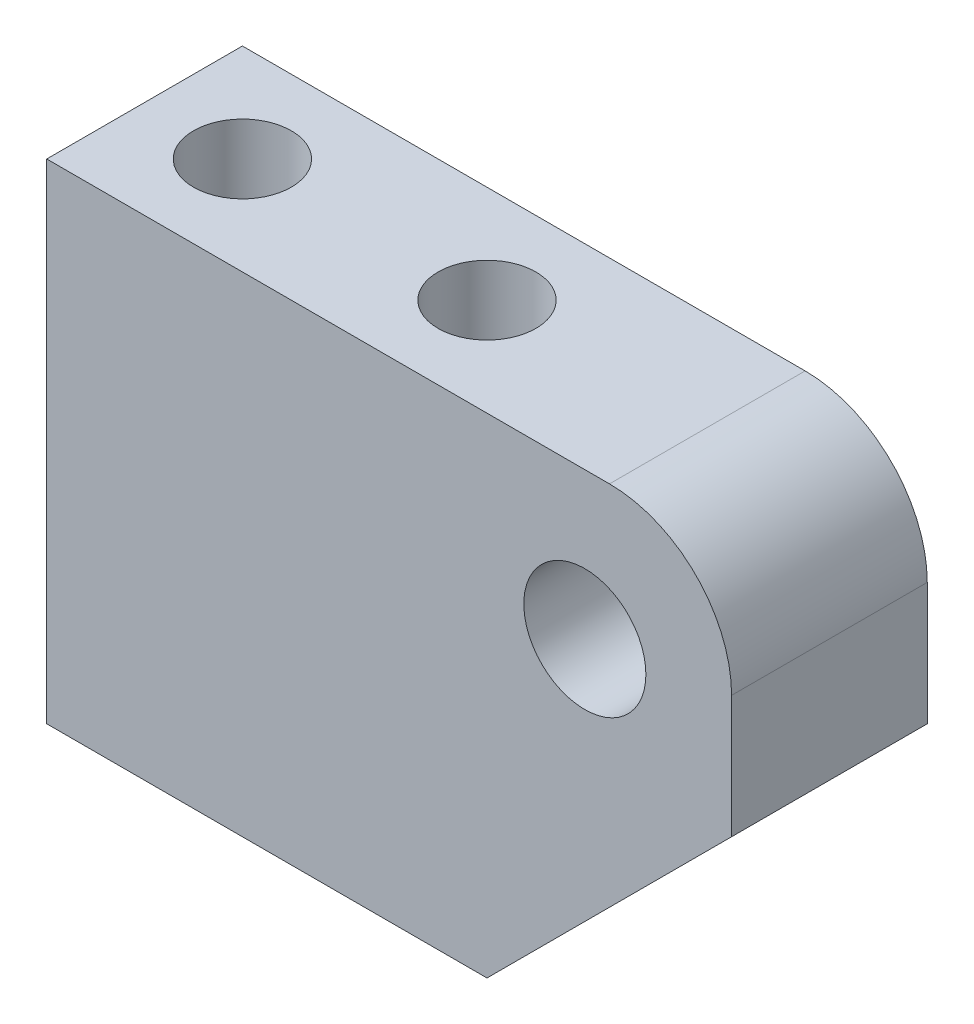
ISO-10303-21;
HEADER;
FILE_DESCRIPTION(('STEP AP214'),'2;1');
FILE_NAME('part.step','',(''),(''),'','','');
FILE_SCHEMA(('AUTOMOTIVE_DESIGN { 1 0 10303 214 1 1 1 1 }'));
ENDSEC;
DATA;
#1=APPLICATION_CONTEXT('core data for automotive mechanical design processes');
#2=APPLICATION_PROTOCOL_DEFINITION('international standard','automotive_design',2000,#1);
#3=PRODUCT_CONTEXT('',#1,'mechanical');
#4=PRODUCT('Part','Part','',(#3));
#5=PRODUCT_RELATED_PRODUCT_CATEGORY('part','',(#4));
#6=PRODUCT_DEFINITION_FORMATION('','',#4);
#7=PRODUCT_DEFINITION_CONTEXT('part definition',#1,'design');
#8=PRODUCT_DEFINITION('design','',#6,#7);
#9=PRODUCT_DEFINITION_SHAPE('','',#8);
#10=(LENGTH_UNIT() NAMED_UNIT(*) SI_UNIT(.MILLI.,.METRE.));
#11=(NAMED_UNIT(*) PLANE_ANGLE_UNIT() SI_UNIT($,.RADIAN.));
#12=(NAMED_UNIT(*) SI_UNIT($,.STERADIAN.) SOLID_ANGLE_UNIT());
#13=UNCERTAINTY_MEASURE_WITH_UNIT(LENGTH_MEASURE(1.E-05),#10,'distance_accuracy_value','');
#14=(GEOMETRIC_REPRESENTATION_CONTEXT(3) GLOBAL_UNCERTAINTY_ASSIGNED_CONTEXT((#13)) GLOBAL_UNIT_ASSIGNED_CONTEXT((#10,
#11,#12)) REPRESENTATION_CONTEXT('',''));
#15=CARTESIAN_POINT('',(0.,0.,0.));
#16=DIRECTION('',(0.,0.,1.));
#17=DIRECTION('',(1.,0.,0.));
#18=AXIS2_PLACEMENT_3D('',#15,#16,#17);
#19=CARTESIAN_POINT('',(0.,0.,6.35));
#20=DIRECTION('',(0.,0.,-1.));
#21=DIRECTION('',(-1.,0.,0.));
#22=AXIS2_PLACEMENT_3D('',#19,#20,#21);
#23=PLANE('',#22);
#24=DIRECTION('',(0.,1.,0.));
#25=VECTOR('',#24,1.);
#26=CARTESIAN_POINT('',(9.525,9.525,6.35));
#27=LINE('',#26,#25);
#28=CARTESIAN_POINT('',(9.525,-6.35,6.35));
#29=VERTEX_POINT('',#28);
#30=CARTESIAN_POINT('',(9.525,1.6002,6.35));
#31=VERTEX_POINT('',#30);
#32=EDGE_CURVE('E82',#29,#31,#27,.T.);
#33=ORIENTED_EDGE('',*,*,#32,.T.);
#34=CARTESIAN_POINT('',(1.6002,1.6002,6.35));
#35=DIRECTION('',(0.,0.,-1.));
#36=DIRECTION('',(-1.,0.,0.));
#37=AXIS2_PLACEMENT_3D('',#34,#35,#36);
#38=CIRCLE('',#37,7.9248);
#39=CARTESIAN_POINT('',(1.6002,9.525,6.35));
#40=VERTEX_POINT('',#39);
#41=EDGE_CURVE('E11',#31,#40,#38,.F.);
#42=ORIENTED_EDGE('',*,*,#41,.T.);
#43=DIRECTION('',(-1.,0.,0.));
#44=VECTOR('',#43,1.);
#45=CARTESIAN_POINT('',(-34.925,9.525,6.35));
#46=LINE('',#45,#44);
#47=CARTESIAN_POINT('',(-34.925,9.525,6.35));
#48=VERTEX_POINT('',#47);
#49=EDGE_CURVE('E90',#40,#48,#46,.T.);
#50=ORIENTED_EDGE('',*,*,#49,.T.);
#51=DIRECTION('',(0.,-1.,0.));
#52=VECTOR('',#51,1.);
#53=CARTESIAN_POINT('',(-34.925,-22.225,6.35));
#54=LINE('',#53,#52);
#55=CARTESIAN_POINT('',(-34.925,-22.225,6.35));
#56=VERTEX_POINT('',#55);
#57=EDGE_CURVE('E139',#48,#56,#54,.T.);
#58=ORIENTED_EDGE('',*,*,#57,.T.);
#59=DIRECTION('',(1.,0.,0.));
#60=VECTOR('',#59,1.);
#61=CARTESIAN_POINT('',(-6.35,-22.225,6.35));
#62=LINE('',#61,#60);
#63=CARTESIAN_POINT('',(-6.35,-22.225,6.35));
#64=VERTEX_POINT('',#63);
#65=EDGE_CURVE('E96',#56,#64,#62,.T.);
#66=ORIENTED_EDGE('',*,*,#65,.T.);
#67=DIRECTION('',(0.707106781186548,0.707106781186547,0.));
#68=VECTOR('',#67,1.);
#69=CARTESIAN_POINT('',(9.525,-6.35,6.35));
#70=LINE('',#69,#68);
#71=EDGE_CURVE('E91',#64,#29,#70,.T.);
#72=ORIENTED_EDGE('',*,*,#71,.T.);
#73=EDGE_LOOP('',(#33,#42,#50,#58,#66,#72));
#74=FACE_BOUND('',#73,.T.);
#75=CARTESIAN_POINT('',(0.,0.,6.35));
#76=DIRECTION('',(0.,0.,1.));
#77=DIRECTION('',(1.,0.,0.));
#78=AXIS2_PLACEMENT_3D('',#75,#76,#77);
#79=CIRCLE('',#78,3.9624);
#80=CARTESIAN_POINT('',(3.9624,0.,6.35));
#81=VERTEX_POINT('',#80);
#82=EDGE_CURVE('E133',#81,#81,#79,.T.);
#83=ORIENTED_EDGE('',*,*,#82,.F.);
#84=EDGE_LOOP('',(#83));
#85=FACE_BOUND('',#84,.T.);
#86=ADVANCED_FACE('F33',(#74,#85),#23,.F.);
#87=CARTESIAN_POINT('',(0.,0.,-6.35));
#88=DIRECTION('',(0.,0.,-1.));
#89=DIRECTION('',(-1.,0.,0.));
#90=AXIS2_PLACEMENT_3D('',#87,#88,#89);
#91=PLANE('',#90);
#92=DIRECTION('',(-1.,0.,0.));
#93=VECTOR('',#92,1.);
#94=CARTESIAN_POINT('',(-34.925,9.525,-6.35));
#95=LINE('',#94,#93);
#96=CARTESIAN_POINT('',(1.6002,9.525,-6.35));
#97=VERTEX_POINT('',#96);
#98=CARTESIAN_POINT('',(-34.925,9.525,-6.35));
#99=VERTEX_POINT('',#98);
#100=EDGE_CURVE('E146',#97,#99,#95,.T.);
#101=ORIENTED_EDGE('',*,*,#100,.F.);
#102=CARTESIAN_POINT('',(1.6002,1.6002,-6.35));
#103=DIRECTION('',(0.,0.,-1.));
#104=DIRECTION('',(-1.,0.,0.));
#105=AXIS2_PLACEMENT_3D('',#102,#103,#104);
#106=CIRCLE('',#105,7.9248);
#107=CARTESIAN_POINT('',(9.525,1.6002,-6.35));
#108=VERTEX_POINT('',#107);
#109=EDGE_CURVE('E55',#97,#108,#106,.T.);
#110=ORIENTED_EDGE('',*,*,#109,.T.);
#111=DIRECTION('',(0.,1.,0.));
#112=VECTOR('',#111,1.);
#113=CARTESIAN_POINT('',(9.525,9.525,-6.35));
#114=LINE('',#113,#112);
#115=CARTESIAN_POINT('',(9.525,-6.35,-6.35));
#116=VERTEX_POINT('',#115);
#117=EDGE_CURVE('E144',#116,#108,#114,.T.);
#118=ORIENTED_EDGE('',*,*,#117,.F.);
#119=DIRECTION('',(0.707106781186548,0.707106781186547,0.));
#120=VECTOR('',#119,1.);
#121=CARTESIAN_POINT('',(9.525,-6.35,-6.35));
#122=LINE('',#121,#120);
#123=CARTESIAN_POINT('',(-6.35,-22.225,-6.35));
#124=VERTEX_POINT('',#123);
#125=EDGE_CURVE('E104',#124,#116,#122,.T.);
#126=ORIENTED_EDGE('',*,*,#125,.F.);
#127=DIRECTION('',(1.,0.,0.));
#128=VECTOR('',#127,1.);
#129=CARTESIAN_POINT('',(-6.35,-22.225,-6.35));
#130=LINE('',#129,#128);
#131=CARTESIAN_POINT('',(-34.925,-22.225,-6.35));
#132=VERTEX_POINT('',#131);
#133=EDGE_CURVE('E100',#132,#124,#130,.T.);
#134=ORIENTED_EDGE('',*,*,#133,.F.);
#135=DIRECTION('',(0.,-1.,0.));
#136=VECTOR('',#135,1.);
#137=CARTESIAN_POINT('',(-34.925,-22.225,-6.35));
#138=LINE('',#137,#136);
#139=EDGE_CURVE('E148',#99,#132,#138,.T.);
#140=ORIENTED_EDGE('',*,*,#139,.F.);
#141=EDGE_LOOP('',(#101,#110,#118,#126,#134,#140));
#142=FACE_BOUND('',#141,.T.);
#143=CARTESIAN_POINT('',(0.,0.,-6.35));
#144=DIRECTION('',(0.,0.,1.));
#145=DIRECTION('',(1.,0.,0.));
#146=AXIS2_PLACEMENT_3D('',#143,#144,#145);
#147=CIRCLE('',#146,3.9624);
#148=CARTESIAN_POINT('',(3.9624,0.,-6.35));
#149=VERTEX_POINT('',#148);
#150=EDGE_CURVE('E132',#149,#149,#147,.T.);
#151=ORIENTED_EDGE('',*,*,#150,.T.);
#152=EDGE_LOOP('',(#151));
#153=FACE_BOUND('',#152,.T.);
#154=ADVANCED_FACE('F159',(#142,#153),#91,.T.);
#155=CARTESIAN_POINT('',(9.525,-6.35,6.35));
#156=DIRECTION('',(-0.707106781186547,0.707106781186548,0.));
#157=DIRECTION('',(-0.707106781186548,-0.707106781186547,0.));
#158=AXIS2_PLACEMENT_3D('',#155,#156,#157);
#159=PLANE('',#158);
#160=ORIENTED_EDGE('',*,*,#125,.T.);
#161=DIRECTION('',(0.,0.,-1.));
#162=VECTOR('',#161,1.);
#163=CARTESIAN_POINT('',(9.525,-6.35,6.35));
#164=LINE('',#163,#162);
#165=EDGE_CURVE('E86',#29,#116,#164,.T.);
#166=ORIENTED_EDGE('',*,*,#165,.F.);
#167=ORIENTED_EDGE('',*,*,#71,.F.);
#168=DIRECTION('',(0.,0.,-1.));
#169=VECTOR('',#168,1.);
#170=CARTESIAN_POINT('',(-6.35,-22.225,6.35));
#171=LINE('',#170,#169);
#172=EDGE_CURVE('E142',#64,#124,#171,.T.);
#173=ORIENTED_EDGE('',*,*,#172,.T.);
#174=EDGE_LOOP('',(#160,#166,#167,#173));
#175=FACE_BOUND('',#174,.T.);
#176=ADVANCED_FACE('F102',(#175),#159,.F.);
#177=CARTESIAN_POINT('',(9.525,9.525,6.35));
#178=DIRECTION('',(-1.,0.,0.));
#179=DIRECTION('',(0.,-1.,0.));
#180=AXIS2_PLACEMENT_3D('',#177,#178,#179);
#181=PLANE('',#180);
#182=ORIENTED_EDGE('',*,*,#117,.T.);
#183=DIRECTION('',(0.,0.,-1.));
#184=VECTOR('',#183,1.);
#185=CARTESIAN_POINT('',(9.525,1.6002,6.35));
#186=LINE('',#185,#184);
#187=EDGE_CURVE('E41',#108,#31,#186,.F.);
#188=ORIENTED_EDGE('',*,*,#187,.T.);
#189=ORIENTED_EDGE('',*,*,#32,.F.);
#190=ORIENTED_EDGE('',*,*,#165,.T.);
#191=EDGE_LOOP('',(#182,#188,#189,#190));
#192=FACE_BOUND('',#191,.T.);
#193=ADVANCED_FACE('F84',(#192),#181,.F.);
#194=CARTESIAN_POINT('',(-34.925,9.525,6.35));
#195=DIRECTION('',(0.,-1.,0.));
#196=DIRECTION('',(0.,0.,-1.));
#197=AXIS2_PLACEMENT_3D('',#194,#195,#196);
#198=PLANE('',#197);
#199=CARTESIAN_POINT('',(-28.575,9.525,0.));
#200=DIRECTION('',(0.,-1.,0.));
#201=DIRECTION('',(0.,0.,-1.));
#202=AXIS2_PLACEMENT_3D('',#199,#200,#201);
#203=CIRCLE('',#202,3.175);
#204=CARTESIAN_POINT('',(-28.575,9.52500000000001,3.175));
#205=VERTEX_POINT('',#204);
#206=EDGE_CURVE('E119',#205,#205,#203,.T.);
#207=ORIENTED_EDGE('',*,*,#206,.T.);
#208=EDGE_LOOP('',(#207));
#209=FACE_BOUND('',#208,.T.);
#210=CARTESIAN_POINT('',(-12.7,9.525,0.));
#211=DIRECTION('',(0.,-1.,0.));
#212=DIRECTION('',(0.,0.,-1.));
#213=AXIS2_PLACEMENT_3D('',#210,#211,#212);
#214=CIRCLE('',#213,3.175);
#215=CARTESIAN_POINT('',(-12.7,9.52500000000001,3.175));
#216=VERTEX_POINT('',#215);
#217=EDGE_CURVE('E118',#216,#216,#214,.T.);
#218=ORIENTED_EDGE('',*,*,#217,.T.);
#219=EDGE_LOOP('',(#218));
#220=FACE_BOUND('',#219,.T.);
#221=ORIENTED_EDGE('',*,*,#49,.F.);
#222=DIRECTION('',(0.,0.,-1.));
#223=VECTOR('',#222,1.);
#224=CARTESIAN_POINT('',(1.6002,9.525,6.35));
#225=LINE('',#224,#223);
#226=EDGE_CURVE('E105',#40,#97,#225,.T.);
#227=ORIENTED_EDGE('',*,*,#226,.T.);
#228=ORIENTED_EDGE('',*,*,#100,.T.);
#229=DIRECTION('',(0.,0.,-1.));
#230=VECTOR('',#229,1.);
#231=CARTESIAN_POINT('',(-34.925,9.525,6.35));
#232=LINE('',#231,#230);
#233=EDGE_CURVE('E106',#48,#99,#232,.T.);
#234=ORIENTED_EDGE('',*,*,#233,.F.);
#235=EDGE_LOOP('',(#221,#227,#228,#234));
#236=FACE_BOUND('',#235,.T.);
#237=ADVANCED_FACE('F166',(#209,#220,#236),#198,.F.);
#238=CARTESIAN_POINT('',(-34.925,-22.225,6.35));
#239=DIRECTION('',(1.,0.,0.));
#240=DIRECTION('',(0.,1.,0.));
#241=AXIS2_PLACEMENT_3D('',#238,#239,#240);
#242=PLANE('',#241);
#243=ORIENTED_EDGE('',*,*,#139,.T.);
#244=DIRECTION('',(0.,0.,-1.));
#245=VECTOR('',#244,1.);
#246=CARTESIAN_POINT('',(-34.925,-22.225,6.35));
#247=LINE('',#246,#245);
#248=EDGE_CURVE('E111',#56,#132,#247,.T.);
#249=ORIENTED_EDGE('',*,*,#248,.F.);
#250=ORIENTED_EDGE('',*,*,#57,.F.);
#251=ORIENTED_EDGE('',*,*,#233,.T.);
#252=EDGE_LOOP('',(#243,#249,#250,#251));
#253=FACE_BOUND('',#252,.T.);
#254=ADVANCED_FACE('F167',(#253),#242,.F.);
#255=CARTESIAN_POINT('',(-6.35,-22.225,6.35));
#256=DIRECTION('',(0.,1.,0.));
#257=DIRECTION('',(-1.,0.,0.));
#258=AXIS2_PLACEMENT_3D('',#255,#256,#257);
#259=PLANE('',#258);
#260=CARTESIAN_POINT('',(-28.575,-22.225,0.));
#261=DIRECTION('',(0.,1.,0.));
#262=DIRECTION('',(-1.,0.,0.));
#263=AXIS2_PLACEMENT_3D('',#260,#261,#262);
#264=CIRCLE('',#263,3.175);
#265=CARTESIAN_POINT('',(-28.575,-22.225,3.175));
#266=VERTEX_POINT('',#265);
#267=EDGE_CURVE('E120',#266,#266,#264,.T.);
#268=ORIENTED_EDGE('',*,*,#267,.T.);
#269=EDGE_LOOP('',(#268));
#270=FACE_BOUND('',#269,.T.);
#271=CARTESIAN_POINT('',(-12.7,-22.225,0.));
#272=DIRECTION('',(0.,1.,0.));
#273=DIRECTION('',(-1.,0.,0.));
#274=AXIS2_PLACEMENT_3D('',#271,#272,#273);
#275=CIRCLE('',#274,3.175);
#276=CARTESIAN_POINT('',(-12.7,-22.225,3.175));
#277=VERTEX_POINT('',#276);
#278=EDGE_CURVE('E115',#277,#277,#275,.T.);
#279=ORIENTED_EDGE('',*,*,#278,.T.);
#280=EDGE_LOOP('',(#279));
#281=FACE_BOUND('',#280,.T.);
#282=ORIENTED_EDGE('',*,*,#133,.T.);
#283=ORIENTED_EDGE('',*,*,#172,.F.);
#284=ORIENTED_EDGE('',*,*,#65,.F.);
#285=ORIENTED_EDGE('',*,*,#248,.T.);
#286=EDGE_LOOP('',(#282,#283,#284,#285));
#287=FACE_BOUND('',#286,.T.);
#288=ADVANCED_FACE('F155',(#270,#281,#287),#259,.F.);
#289=CARTESIAN_POINT('',(0.,0.,6.35));
#290=DIRECTION('',(0.,0.,-1.));
#291=DIRECTION('',(-1.,0.,0.));
#292=AXIS2_PLACEMENT_3D('',#289,#290,#291);
#293=CYLINDRICAL_SURFACE('',#292,3.9624);
#294=ORIENTED_EDGE('',*,*,#82,.T.);
#295=EDGE_LOOP('',(#294));
#296=FACE_BOUND('',#295,.T.);
#297=ORIENTED_EDGE('',*,*,#150,.F.);
#298=EDGE_LOOP('',(#297));
#299=FACE_BOUND('',#298,.T.);
#300=ADVANCED_FACE('F174',(#296,#299),#293,.F.);
#301=CARTESIAN_POINT('',(-12.7,-38.1,0.));
#302=DIRECTION('',(0.,1.,0.));
#303=DIRECTION('',(0.,0.,1.));
#304=AXIS2_PLACEMENT_3D('',#301,#302,#303);
#305=CYLINDRICAL_SURFACE('',#304,3.175);
#306=CARTESIAN_POINT('',(-12.7,-22.225,3.175));
#307=CARTESIAN_POINT('',(-12.7,-21.8942708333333,3.175));
#308=CARTESIAN_POINT('',(-12.7,-21.5635416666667,3.175));
#309=CARTESIAN_POINT('',(-12.7,-20.9020833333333,3.175));
#310=CARTESIAN_POINT('',(-12.7,-20.5713541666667,3.175));
#311=CARTESIAN_POINT('',(-12.7,-19.9098958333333,3.175));
#312=CARTESIAN_POINT('',(-12.7,-19.5791666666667,3.175));
#313=CARTESIAN_POINT('',(-12.7,-18.9177083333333,3.175));
#314=CARTESIAN_POINT('',(-12.7,-18.5869791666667,3.175));
#315=CARTESIAN_POINT('',(-12.7,-17.9255208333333,3.175));
#316=CARTESIAN_POINT('',(-12.7,-17.5947916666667,3.175));
#317=CARTESIAN_POINT('',(-12.7,-16.9333333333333,3.175));
#318=CARTESIAN_POINT('',(-12.7,-16.6026041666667,3.175));
#319=CARTESIAN_POINT('',(-12.7,-15.9411458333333,3.175));
#320=CARTESIAN_POINT('',(-12.7,-15.6104166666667,3.175));
#321=CARTESIAN_POINT('',(-12.7,-14.9489583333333,3.175));
#322=CARTESIAN_POINT('',(-12.7,-14.6182291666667,3.175));
#323=CARTESIAN_POINT('',(-12.7,-13.9567708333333,3.175));
#324=CARTESIAN_POINT('',(-12.7,-13.6260416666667,3.175));
#325=CARTESIAN_POINT('',(-12.7,-12.9645833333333,3.175));
#326=CARTESIAN_POINT('',(-12.7,-12.6338541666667,3.175));
#327=CARTESIAN_POINT('',(-12.7,-11.9723958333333,3.175));
#328=CARTESIAN_POINT('',(-12.7,-11.6416666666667,3.175));
#329=CARTESIAN_POINT('',(-12.7,-10.9802083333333,3.175));
#330=CARTESIAN_POINT('',(-12.7,-10.6494791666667,3.175));
#331=CARTESIAN_POINT('',(-12.7,-9.98802083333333,3.175));
#332=CARTESIAN_POINT('',(-12.7,-9.65729166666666,3.175));
#333=CARTESIAN_POINT('',(-12.7,-8.99583333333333,3.175));
#334=CARTESIAN_POINT('',(-12.7,-8.66510416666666,3.175));
#335=CARTESIAN_POINT('',(-12.7,-8.00364583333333,3.175));
#336=CARTESIAN_POINT('',(-12.7,-7.67291666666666,3.175));
#337=CARTESIAN_POINT('',(-12.7,-7.01145833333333,3.175));
#338=CARTESIAN_POINT('',(-12.7,-6.68072916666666,3.175));
#339=CARTESIAN_POINT('',(-12.7,-6.01927083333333,3.175));
#340=CARTESIAN_POINT('',(-12.7,-5.68854166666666,3.175));
#341=CARTESIAN_POINT('',(-12.7,-5.02708333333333,3.175));
#342=CARTESIAN_POINT('',(-12.7,-4.69635416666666,3.175));
#343=CARTESIAN_POINT('',(-12.7,-4.03489583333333,3.175));
#344=CARTESIAN_POINT('',(-12.7,-3.70416666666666,3.175));
#345=CARTESIAN_POINT('',(-12.7,-3.04270833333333,3.175));
#346=CARTESIAN_POINT('',(-12.7,-2.71197916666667,3.175));
#347=CARTESIAN_POINT('',(-12.7,-2.05052083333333,3.175));
#348=CARTESIAN_POINT('',(-12.7,-1.71979166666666,3.175));
#349=CARTESIAN_POINT('',(-12.7,-1.05833333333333,3.175));
#350=CARTESIAN_POINT('',(-12.7,-0.727604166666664,3.175));
#351=CARTESIAN_POINT('',(-12.7,-0.0661458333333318,3.175));
#352=CARTESIAN_POINT('',(-12.7,0.264583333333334,3.175));
#353=CARTESIAN_POINT('',(-12.7,0.926041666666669,3.175));
#354=CARTESIAN_POINT('',(-12.7,1.25677083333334,3.175));
#355=CARTESIAN_POINT('',(-12.7,1.91822916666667,3.175));
#356=CARTESIAN_POINT('',(-12.7,2.24895833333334,3.175));
#357=CARTESIAN_POINT('',(-12.7,2.91041666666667,3.175));
#358=CARTESIAN_POINT('',(-12.7,3.24114583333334,3.175));
#359=CARTESIAN_POINT('',(-12.7,3.90260416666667,3.175));
#360=CARTESIAN_POINT('',(-12.7,4.23333333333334,3.175));
#361=CARTESIAN_POINT('',(-12.7,4.89479166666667,3.175));
#362=CARTESIAN_POINT('',(-12.7,5.22552083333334,3.175));
#363=CARTESIAN_POINT('',(-12.7,5.88697916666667,3.175));
#364=CARTESIAN_POINT('',(-12.7,6.21770833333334,3.175));
#365=CARTESIAN_POINT('',(-12.7,6.87916666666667,3.175));
#366=CARTESIAN_POINT('',(-12.7,7.20989583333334,3.175));
#367=CARTESIAN_POINT('',(-12.7,7.87135416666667,3.175));
#368=CARTESIAN_POINT('',(-12.7,8.20208333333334,3.175));
#369=CARTESIAN_POINT('',(-12.7,8.86354166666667,3.175));
#370=CARTESIAN_POINT('',(-12.7,9.19427083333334,3.175));
#371=CARTESIAN_POINT('',(-12.7,9.52500000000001,3.175));
#372=B_SPLINE_CURVE_WITH_KNOTS('',3,(#306,#307,#308,#309,#310,#311,#312,#313,#314,#315,#316,
#317,#318,#319,#320,#321,#322,#323,#324,#325,#326,#327,#328,#329,#330,#331,#332,#333,#334,#335,
#336,#337,#338,#339,#340,#341,#342,#343,#344,#345,#346,#347,#348,#349,#350,#351,#352,#353,#354,
#355,#356,#357,#358,#359,#360,#361,#362,#363,#364,#365,#366,#367,#368,#369,#370,#371),
.UNSPECIFIED.,.F.,.F.,(4,2,2,2,2,2,2,2,2,2,2,2,2,2,2,2,2,2,2,2,2,2,2,2,2,2,2,2,2,2,2,2,4),(0.,
0.992187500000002,1.984375,2.9765625,3.96875,4.9609375,5.953125,6.9453125,7.9375,8.9296875,
9.921875,10.9140625,11.90625,12.8984375,13.890625,14.8828125,15.875,16.8671875,17.859375,
18.8515625,19.84375,20.8359375,21.828125,22.8203125,23.8125,24.8046875,25.796875,26.7890625,
27.78125,28.7734375,29.765625,30.7578125,31.75),.UNSPECIFIED.);
#373=EDGE_CURVE('BSEAM186',#277,#216,#372,.T.);
#374=ORIENTED_EDGE('',*,*,#278,.F.);
#375=ORIENTED_EDGE('',*,*,#217,.F.);
#376=ORIENTED_EDGE('',*,*,#373,.T.);
#377=ORIENTED_EDGE('',*,*,#373,.F.);
#378=EDGE_LOOP('',(#374,#376,#375,#377));
#379=FACE_BOUND('',#378,.T.);
#380=ADVANCED_FACE('F186',(#379),#305,.F.);
#381=CARTESIAN_POINT('',(-28.575,-38.1,0.));
#382=DIRECTION('',(0.,1.,0.));
#383=DIRECTION('',(0.,0.,1.));
#384=AXIS2_PLACEMENT_3D('',#381,#382,#383);
#385=CYLINDRICAL_SURFACE('',#384,3.175);
#386=CARTESIAN_POINT('',(-28.575,-22.225,3.175));
#387=CARTESIAN_POINT('',(-28.575,-21.8942708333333,3.175));
#388=CARTESIAN_POINT('',(-28.575,-21.5635416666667,3.175));
#389=CARTESIAN_POINT('',(-28.575,-20.9020833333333,3.175));
#390=CARTESIAN_POINT('',(-28.575,-20.5713541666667,3.175));
#391=CARTESIAN_POINT('',(-28.575,-19.9098958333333,3.175));
#392=CARTESIAN_POINT('',(-28.575,-19.5791666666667,3.175));
#393=CARTESIAN_POINT('',(-28.575,-18.9177083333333,3.175));
#394=CARTESIAN_POINT('',(-28.575,-18.5869791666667,3.175));
#395=CARTESIAN_POINT('',(-28.575,-17.9255208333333,3.175));
#396=CARTESIAN_POINT('',(-28.575,-17.5947916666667,3.175));
#397=CARTESIAN_POINT('',(-28.575,-16.9333333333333,3.175));
#398=CARTESIAN_POINT('',(-28.575,-16.6026041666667,3.175));
#399=CARTESIAN_POINT('',(-28.575,-15.9411458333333,3.175));
#400=CARTESIAN_POINT('',(-28.575,-15.6104166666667,3.175));
#401=CARTESIAN_POINT('',(-28.575,-14.9489583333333,3.175));
#402=CARTESIAN_POINT('',(-28.575,-14.6182291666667,3.175));
#403=CARTESIAN_POINT('',(-28.575,-13.9567708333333,3.175));
#404=CARTESIAN_POINT('',(-28.575,-13.6260416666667,3.175));
#405=CARTESIAN_POINT('',(-28.575,-12.9645833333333,3.175));
#406=CARTESIAN_POINT('',(-28.575,-12.6338541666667,3.175));
#407=CARTESIAN_POINT('',(-28.575,-11.9723958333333,3.175));
#408=CARTESIAN_POINT('',(-28.575,-11.6416666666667,3.175));
#409=CARTESIAN_POINT('',(-28.575,-10.9802083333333,3.175));
#410=CARTESIAN_POINT('',(-28.575,-10.6494791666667,3.175));
#411=CARTESIAN_POINT('',(-28.575,-9.98802083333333,3.175));
#412=CARTESIAN_POINT('',(-28.575,-9.65729166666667,3.175));
#413=CARTESIAN_POINT('',(-28.575,-8.99583333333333,3.175));
#414=CARTESIAN_POINT('',(-28.575,-8.66510416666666,3.175));
#415=CARTESIAN_POINT('',(-28.575,-8.00364583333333,3.175));
#416=CARTESIAN_POINT('',(-28.575,-7.67291666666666,3.175));
#417=CARTESIAN_POINT('',(-28.575,-7.01145833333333,3.175));
#418=CARTESIAN_POINT('',(-28.575,-6.68072916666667,3.175));
#419=CARTESIAN_POINT('',(-28.575,-6.01927083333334,3.175));
#420=CARTESIAN_POINT('',(-28.575,-5.68854166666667,3.175));
#421=CARTESIAN_POINT('',(-28.575,-5.02708333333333,3.175));
#422=CARTESIAN_POINT('',(-28.575,-4.69635416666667,3.175));
#423=CARTESIAN_POINT('',(-28.575,-4.03489583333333,3.175));
#424=CARTESIAN_POINT('',(-28.575,-3.70416666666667,3.175));
#425=CARTESIAN_POINT('',(-28.575,-3.04270833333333,3.175));
#426=CARTESIAN_POINT('',(-28.575,-2.71197916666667,3.175));
#427=CARTESIAN_POINT('',(-28.575,-2.05052083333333,3.175));
#428=CARTESIAN_POINT('',(-28.575,-1.71979166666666,3.175));
#429=CARTESIAN_POINT('',(-28.575,-1.05833333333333,3.175));
#430=CARTESIAN_POINT('',(-28.575,-0.727604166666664,3.175));
#431=CARTESIAN_POINT('',(-28.575,-0.0661458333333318,3.175));
#432=CARTESIAN_POINT('',(-28.575,0.264583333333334,3.175));
#433=CARTESIAN_POINT('',(-28.575,0.926041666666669,3.175));
#434=CARTESIAN_POINT('',(-28.575,1.25677083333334,3.175));
#435=CARTESIAN_POINT('',(-28.575,1.91822916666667,3.175));
#436=CARTESIAN_POINT('',(-28.575,2.24895833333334,3.175));
#437=CARTESIAN_POINT('',(-28.575,2.91041666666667,3.175));
#438=CARTESIAN_POINT('',(-28.575,3.24114583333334,3.175));
#439=CARTESIAN_POINT('',(-28.575,3.90260416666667,3.175));
#440=CARTESIAN_POINT('',(-28.575,4.23333333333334,3.175));
#441=CARTESIAN_POINT('',(-28.575,4.89479166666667,3.175));
#442=CARTESIAN_POINT('',(-28.575,5.22552083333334,3.175));
#443=CARTESIAN_POINT('',(-28.575,5.88697916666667,3.175));
#444=CARTESIAN_POINT('',(-28.575,6.21770833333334,3.175));
#445=CARTESIAN_POINT('',(-28.575,6.87916666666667,3.175));
#446=CARTESIAN_POINT('',(-28.575,7.20989583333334,3.175));
#447=CARTESIAN_POINT('',(-28.575,7.87135416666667,3.175));
#448=CARTESIAN_POINT('',(-28.575,8.20208333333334,3.175));
#449=CARTESIAN_POINT('',(-28.575,8.86354166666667,3.175));
#450=CARTESIAN_POINT('',(-28.575,9.19427083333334,3.175));
#451=CARTESIAN_POINT('',(-28.575,9.52500000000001,3.175));
#452=B_SPLINE_CURVE_WITH_KNOTS('',3,(#386,#387,#388,#389,#390,#391,#392,#393,#394,#395,#396,
#397,#398,#399,#400,#401,#402,#403,#404,#405,#406,#407,#408,#409,#410,#411,#412,#413,#414,#415,
#416,#417,#418,#419,#420,#421,#422,#423,#424,#425,#426,#427,#428,#429,#430,#431,#432,#433,#434,
#435,#436,#437,#438,#439,#440,#441,#442,#443,#444,#445,#446,#447,#448,#449,#450,#451),
.UNSPECIFIED.,.F.,.F.,(4,2,2,2,2,2,2,2,2,2,2,2,2,2,2,2,2,2,2,2,2,2,2,2,2,2,2,2,2,2,2,2,4),(0.,
0.992187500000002,1.984375,2.9765625,3.96875,4.9609375,5.953125,6.9453125,7.9375,
8.92968750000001,9.921875,10.9140625,11.90625,12.8984375,13.890625,14.8828125,15.875,16.8671875,
17.859375,18.8515625,19.84375,20.8359375,21.828125,22.8203125,23.8125,24.8046875,25.796875,
26.7890625,27.78125,28.7734375,29.765625,30.7578125,31.75),.UNSPECIFIED.);
#453=EDGE_CURVE('BSEAM190',#266,#205,#452,.T.);
#454=ORIENTED_EDGE('',*,*,#267,.F.);
#455=ORIENTED_EDGE('',*,*,#206,.F.);
#456=ORIENTED_EDGE('',*,*,#453,.T.);
#457=ORIENTED_EDGE('',*,*,#453,.F.);
#458=EDGE_LOOP('',(#454,#456,#455,#457));
#459=FACE_BOUND('',#458,.T.);
#460=ADVANCED_FACE('F190',(#459),#385,.F.);
#461=CARTESIAN_POINT('',(1.6002,1.6002,6.35));
#462=DIRECTION('',(0.,0.,-1.));
#463=DIRECTION('',(-1.,0.,0.));
#464=AXIS2_PLACEMENT_3D('',#461,#462,#463);
#465=CYLINDRICAL_SURFACE('',#464,7.9248);
#466=ORIENTED_EDGE('',*,*,#41,.F.);
#467=ORIENTED_EDGE('',*,*,#187,.F.);
#468=ORIENTED_EDGE('',*,*,#109,.F.);
#469=ORIENTED_EDGE('',*,*,#226,.F.);
#470=EDGE_LOOP('',(#466,#467,#468,#469));
#471=FACE_BOUND('',#470,.T.);
#472=ADVANCED_FACE('F35',(#471),#465,.T.);
#473=CLOSED_SHELL('',(#86,#154,#176,#193,#237,#254,#288,#300,#380,#460,#472));
#474=MANIFOLD_SOLID_BREP('B2',#473);
#475=ADVANCED_BREP_SHAPE_REPRESENTATION('',(#18,#474),#14);
#476=SHAPE_DEFINITION_REPRESENTATION(#9,#475);
ENDSEC;
END-ISO-10303-21;
